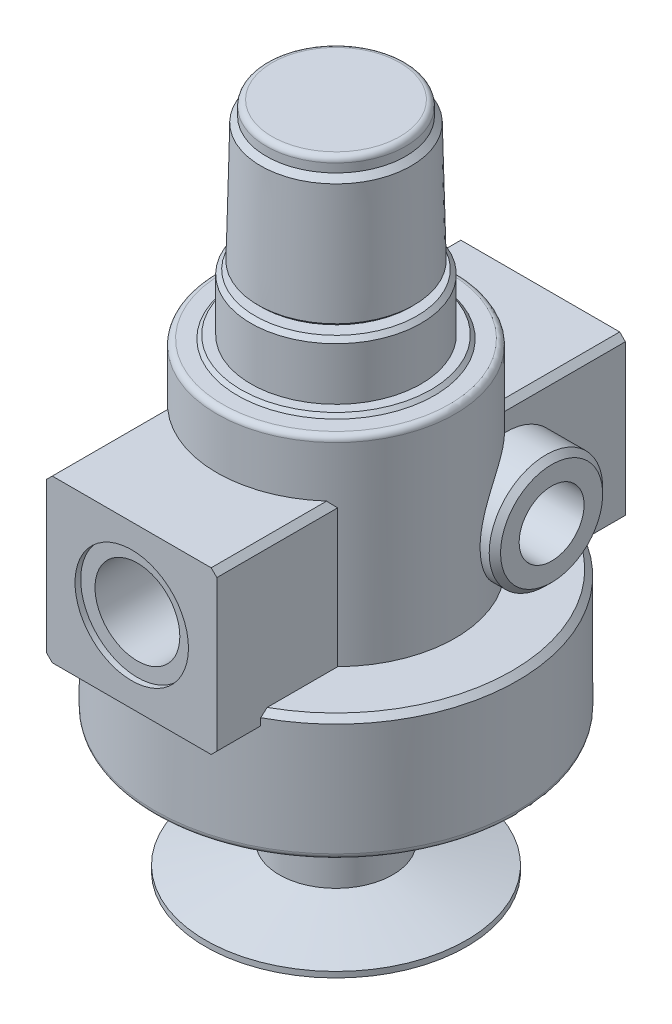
from build123d import *

# Parameters (mm, degrees)
EXTRUDE_1_DEPTH      = 36
EXTRUDE_1_DEPTH_BACK = 36
SKETCH_6_W           = 12
SKETCH_6_H           = 5.7225
SKETCH_7_W           = 12
SKETCH_7_H           = 5.7225


with BuildPart() as part:
    # Sketch 1 → Revolve 1 (revolve)
    with BuildSketch(Plane.XY, mode=Mode.PRIVATE) as revolve_1_sk:
        with BuildLine():
            Line((0, -24.3), (-23, -24.3))
            Line((-23, -24.3), (-23, -23.3))
            Line((-23, -23.3), (-10, -19.816660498))
            Line((-10, -19.816660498), (-10, 0))
            Line((-10, 0), (-23, 0))
            Line((-23, 0), (-23, 1))
            Line((-23, 1), (-10, 4.483339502))
            Line((-10, 4.483339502), (-10, 5.7))
            Line((-10, 5.7), (-30, 5.7))
            Line((-30, 5.7), (-30, 0))
            Line((-30, 0), (-31, 0))
            ThreePointArc((-31, 0), (-31.707106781, 0.292893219), (-32, 1))
            Line((-32, 1), (-32, 20.8))
            Line((-32, 20.8), (-31, 21.8))
            Line((-31, 21.8), (-21, 21.8))
            Line((-21, 21.8), (-21, 56))
            ThreePointArc((-21, 56), (-20.707106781, 56.707106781), (-20, 57))
            Line((-20, 57), (-17.35, 57))
            Line((-17.35, 57), (-16.75, 57.6))
            Line((-16.75, 57.6), (-15, 57.6))
            Line((-15, 57.6), (-15, 66.85))
            Line((-15, 66.85), (-14.25, 67.6))
            Line((-14.25, 67.6), (-11.5, 67.6))
            Line((-11.5, 67.6), (-11.5, 68.5))
            Line((-11.5, 68.5), (-13.25, 68.5))
            Line((-13.25, 68.5), (-13.738375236, 68.999864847))
            Line((-13.738375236, 68.999864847), (-13.25, 90))
            Line((-13.25, 90), (-12.2727, 90.9773))
            Line((-12.2727, 90.9773), (-12.2727, 92.5))
            ThreePointArc((-12.2727, 92.5), (-11.979806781, 93.207106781), (-11.2727, 93.5))
            Line((-11.2727, 93.5), (0, 93.5))
            Line((0, 93.5), (0, -24.3))
        make_face()
    revolve(revolve_1_sk.sketch.rotate(Axis((0, 93.5, 0), (0, -1, 0)), 90), axis=Axis((0, 93.5, 0), (0, -1, 0)))

    # Sketch 2 → Extrude 1 (add, two sides: drawn at the far end of the back side and taken through both)
    with BuildSketch(Plane.XY.offset(-EXTRUDE_1_DEPTH_BACK)):
        Polygon((-15, 46.05), (-15, 19.55), (-14, 18.55), (14, 18.55), (15, 19.55), (15, 46.05), (14, 47.05), (-14, 47.05), align=None)
    extrude(amount=EXTRUDE_1_DEPTH + EXTRUDE_1_DEPTH_BACK)

    # Sketch 3 → Revolve 2 (revolve)
    with BuildSketch(Plane.XY.offset(-15), mode=Mode.PRIVATE) as revolve_2_sk:
        Polygon((-23, 32.8), (-23, 41.8), (-22, 42.8), (22, 42.8), (23, 41.8), (23, 32.8), align=None)
    revolve(revolve_2_sk.sketch.rotate(Axis((23, 32.8, -15), (-1, 0, 0)), 270), axis=Axis((23, 32.8, -15), (-1, 0, 0)))

    # Sketch 4 → Cut-Revolve 1 (revolve, cut)
    with BuildSketch(Plane(origin=(0, 0, 0), x_dir=(0, 0, -1), z_dir=(1, 0, 0)), mode=Mode.PRIVATE) as cut_revolve_1_sk:
        Polygon((-36, 32.8), (-36, 42.7972), (-35, 42.7972), (-35, 40.275), (-24, 40.275), (-24, 32.8), align=None)
    revolve(cut_revolve_1_sk.sketch.rotate(Axis((0, 32.8, 24), (0, 0, 1)), 270), axis=Axis((0, 32.8, 24), (0, 0, 1)), mode=Mode.SUBTRACT)

    # Sketch 5 → Cut-Revolve 2 (revolve, cut)
    with BuildSketch(Plane(origin=(0, 0, 0), x_dir=(0, 0, -1), z_dir=(1, 0, 0)), mode=Mode.PRIVATE) as cut_revolve_2_sk:
        Polygon((24, 32.8), (24, 40.275), (35, 40.275), (35, 42.7972), (36, 42.7972), (36, 32.8), align=None)
    revolve(cut_revolve_2_sk.sketch.rotate(Axis((0, 32.8, -36), (0, 0, 1)), 270), axis=Axis((0, 32.8, -36), (0, 0, 1)), mode=Mode.SUBTRACT)

    # Sketch 6 → Cut-Revolve 3 (revolve, cut)
    with BuildSketch(Plane.XY.offset(-15), mode=Mode.PRIVATE) as cut_revolve_3_sk:
        with Locations((17, 35.66125)):
            Rectangle(SKETCH_6_W, SKETCH_6_H)
    revolve(cut_revolve_3_sk.sketch.rotate(Axis((23, 32.8, -15), (-1, 0, 0)), 270), axis=Axis((23, 32.8, -15), (-1, 0, 0)), mode=Mode.SUBTRACT)

    # Sketch 7 → Cut-Revolve 4 (revolve, cut)
    with BuildSketch(Plane.XY.offset(-15), mode=Mode.PRIVATE) as cut_revolve_4_sk:
        with Locations((-17, 35.66125)):
            Rectangle(SKETCH_7_W, SKETCH_7_H)
    revolve(cut_revolve_4_sk.sketch.rotate(Axis((-11, 32.8, -15), (-1, 0, 0)), 270), axis=Axis((-11, 32.8, -15), (-1, 0, 0)), mode=Mode.SUBTRACT)


solid = part.part
